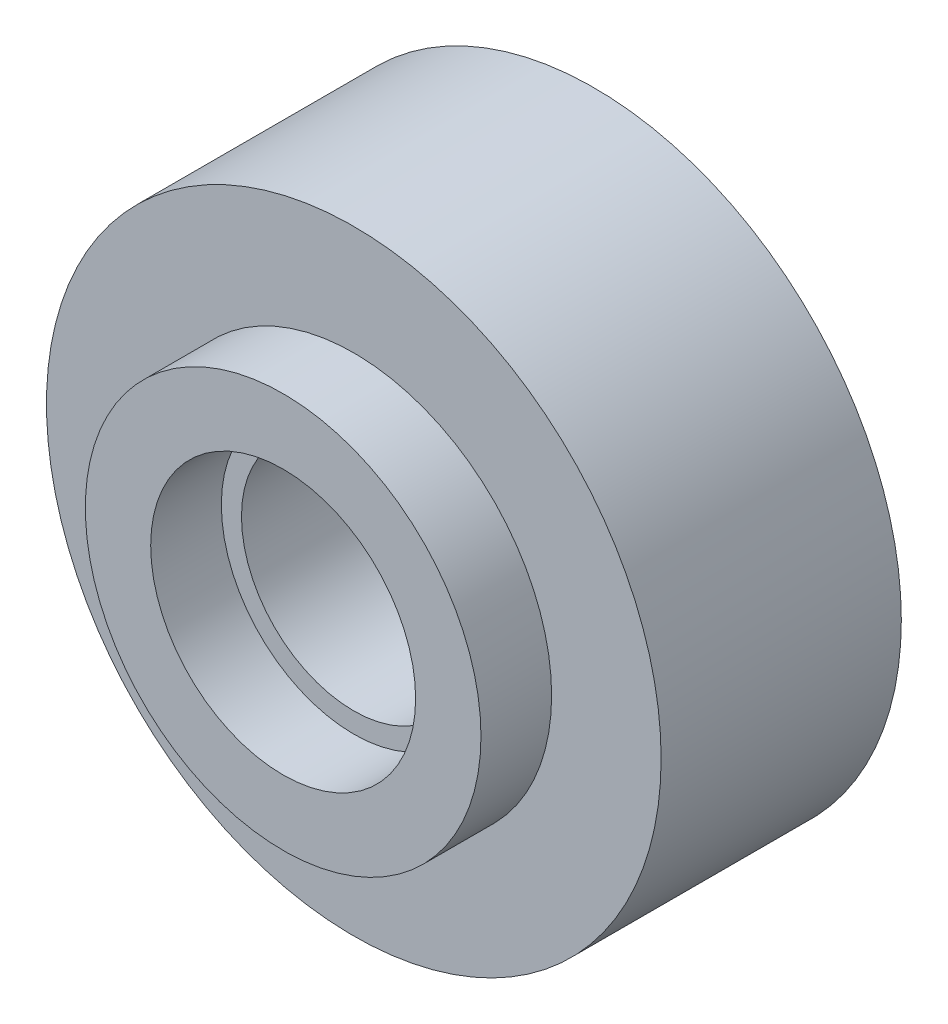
ISO-10303-21;
HEADER;
FILE_DESCRIPTION(('STEP AP214'),'2;1');
FILE_NAME('part.step','',(''),(''),'','','');
FILE_SCHEMA(('AUTOMOTIVE_DESIGN { 1 0 10303 214 1 1 1 1 }'));
ENDSEC;
DATA;
#1=APPLICATION_CONTEXT('core data for automotive mechanical design processes');
#2=APPLICATION_PROTOCOL_DEFINITION('international standard','automotive_design',2000,#1);
#3=PRODUCT_CONTEXT('',#1,'mechanical');
#4=PRODUCT('Part','Part','',(#3));
#5=PRODUCT_RELATED_PRODUCT_CATEGORY('part','',(#4));
#6=PRODUCT_DEFINITION_FORMATION('','',#4);
#7=PRODUCT_DEFINITION_CONTEXT('part definition',#1,'design');
#8=PRODUCT_DEFINITION('design','',#6,#7);
#9=PRODUCT_DEFINITION_SHAPE('','',#8);
#10=(LENGTH_UNIT() NAMED_UNIT(*) SI_UNIT(.MILLI.,.METRE.));
#11=(NAMED_UNIT(*) PLANE_ANGLE_UNIT() SI_UNIT($,.RADIAN.));
#12=(NAMED_UNIT(*) SI_UNIT($,.STERADIAN.) SOLID_ANGLE_UNIT());
#13=UNCERTAINTY_MEASURE_WITH_UNIT(LENGTH_MEASURE(1.E-05),#10,'distance_accuracy_value','');
#14=(GEOMETRIC_REPRESENTATION_CONTEXT(3) GLOBAL_UNCERTAINTY_ASSIGNED_CONTEXT((#13)) GLOBAL_UNIT_ASSIGNED_CONTEXT((#10,
#11,#12)) REPRESENTATION_CONTEXT('',''));
#15=CARTESIAN_POINT('',(0.,0.,0.));
#16=DIRECTION('',(0.,0.,1.));
#17=DIRECTION('',(1.,0.,0.));
#18=AXIS2_PLACEMENT_3D('',#15,#16,#17);
#19=CARTESIAN_POINT('',(0.,2.22044604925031E-13,5.58800000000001));
#20=DIRECTION('',(0.,0.,1.));
#21=DIRECTION('',(1.00000000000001,0.,0.));
#22=AXIS2_PLACEMENT_3D('',#19,#20,#21);
#23=PLANE('',#22);
#24=CARTESIAN_POINT('',(0.,2.22044604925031E-13,5.58800000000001));
#25=DIRECTION('',(0.,0.,1.));
#26=DIRECTION('',(1.00000000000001,0.,0.));
#27=AXIS2_PLACEMENT_3D('',#24,#25,#26);
#28=CIRCLE('',#27,2.38125);
#29=CARTESIAN_POINT('',(2.38125000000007,2.24291765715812E-13,5.58800000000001));
#30=VERTEX_POINT('',#29);
#31=EDGE_CURVE('E45',#30,#30,#28,.T.);
#32=ORIENTED_EDGE('',*,*,#31,.F.);
#33=EDGE_LOOP('',(#32));
#34=FACE_BOUND('',#33,.T.);
#35=CARTESIAN_POINT('',(0.,2.22044604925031E-13,5.58800000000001));
#36=DIRECTION('',(0.,0.,1.));
#37=DIRECTION('',(1.00000000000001,0.,0.));
#38=AXIS2_PLACEMENT_3D('',#35,#36,#37);
#39=CIRCLE('',#38,3.556);
#40=CARTESIAN_POINT('',(3.55600000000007,2.25400365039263E-13,5.588));
#41=VERTEX_POINT('',#40);
#42=EDGE_CURVE('E50',#41,#41,#39,.T.);
#43=ORIENTED_EDGE('',*,*,#42,.T.);
#44=EDGE_LOOP('',(#43));
#45=FACE_BOUND('',#44,.T.);
#46=ADVANCED_FACE('F33',(#34,#45),#23,.T.);
#47=CARTESIAN_POINT('',(0.,2.22044604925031E-13,4.31799999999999));
#48=DIRECTION('',(0.,0.,1.));
#49=DIRECTION('',(1.00000000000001,0.,0.));
#50=AXIS2_PLACEMENT_3D('',#47,#48,#49);
#51=CYLINDRICAL_SURFACE('',#50,2.38125);
#52=CARTESIAN_POINT('',(0.,2.22044604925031E-13,4.31799999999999));
#53=DIRECTION('',(0.,0.,1.));
#54=DIRECTION('',(1.00000000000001,0.,0.));
#55=AXIS2_PLACEMENT_3D('',#52,#53,#54);
#56=CIRCLE('',#55,2.38125);
#57=CARTESIAN_POINT('',(2.38125000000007,2.24291765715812E-13,4.31799999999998));
#58=VERTEX_POINT('',#57);
#59=EDGE_CURVE('E41',#58,#58,#56,.T.);
#60=ORIENTED_EDGE('',*,*,#59,.F.);
#61=EDGE_LOOP('',(#60));
#62=FACE_BOUND('',#61,.T.);
#63=ORIENTED_EDGE('',*,*,#31,.T.);
#64=EDGE_LOOP('',(#63));
#65=FACE_BOUND('',#64,.T.);
#66=ADVANCED_FACE('F78',(#62,#65),#51,.F.);
#67=CARTESIAN_POINT('',(0.,2.22044604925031E-13,4.31799999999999));
#68=DIRECTION('',(0.,0.,1.));
#69=DIRECTION('',(1.00000000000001,0.,0.));
#70=AXIS2_PLACEMENT_3D('',#67,#68,#69);
#71=PLANE('',#70);
#72=CARTESIAN_POINT('',(0.,2.22044604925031E-13,4.31799999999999));
#73=DIRECTION('',(0.,0.,1.));
#74=DIRECTION('',(1.00000000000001,0.,0.));
#75=AXIS2_PLACEMENT_3D('',#72,#73,#74);
#76=CIRCLE('',#75,2.0193);
#77=CARTESIAN_POINT('',(2.01930000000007,2.23950197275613E-13,4.31799999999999));
#78=VERTEX_POINT('',#77);
#79=EDGE_CURVE('E54',#78,#78,#76,.T.);
#80=ORIENTED_EDGE('',*,*,#79,.F.);
#81=EDGE_LOOP('',(#80));
#82=FACE_BOUND('',#81,.T.);
#83=ORIENTED_EDGE('',*,*,#59,.T.);
#84=EDGE_LOOP('',(#83));
#85=FACE_BOUND('',#84,.T.);
#86=ADVANCED_FACE('F83',(#82,#85),#71,.T.);
#87=CARTESIAN_POINT('',(0.,2.22044604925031E-13,4.31799999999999));
#88=DIRECTION('',(0.,0.,1.));
#89=DIRECTION('',(1.00000000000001,0.,0.));
#90=AXIS2_PLACEMENT_3D('',#87,#88,#89);
#91=PLANE('',#90);
#92=CARTESIAN_POINT('',(0.,2.22044604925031E-13,4.31799999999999));
#93=DIRECTION('',(0.,0.,1.));
#94=DIRECTION('',(1.00000000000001,0.,0.));
#95=AXIS2_PLACEMENT_3D('',#92,#93,#94);
#96=CIRCLE('',#95,3.556);
#97=CARTESIAN_POINT('',(3.55600000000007,2.25400365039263E-13,4.31799999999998));
#98=VERTEX_POINT('',#97);
#99=EDGE_CURVE('E53',#98,#98,#96,.T.);
#100=ORIENTED_EDGE('',*,*,#99,.F.);
#101=EDGE_LOOP('',(#100));
#102=FACE_BOUND('',#101,.T.);
#103=CARTESIAN_POINT('',(0.,2.22044604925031E-13,4.31799999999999));
#104=DIRECTION('',(0.,0.,1.));
#105=DIRECTION('',(1.00000000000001,0.,0.));
#106=AXIS2_PLACEMENT_3D('',#103,#104,#105);
#107=CIRCLE('',#106,5.5245);
#108=CARTESIAN_POINT('',(5.52450000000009,2.27258017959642E-13,4.31799999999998));
#109=VERTEX_POINT('',#108);
#110=EDGE_CURVE('E37',#109,#109,#107,.T.);
#111=ORIENTED_EDGE('',*,*,#110,.T.);
#112=EDGE_LOOP('',(#111));
#113=FACE_BOUND('',#112,.T.);
#114=ADVANCED_FACE('F73',(#102,#113),#91,.T.);
#115=CARTESIAN_POINT('',(0.,2.22044604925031E-13,4.31799999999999));
#116=DIRECTION('',(0.,0.,1.));
#117=DIRECTION('',(1.00000000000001,0.,0.));
#118=AXIS2_PLACEMENT_3D('',#115,#116,#117);
#119=CYLINDRICAL_SURFACE('',#118,3.556);
#120=ORIENTED_EDGE('',*,*,#99,.T.);
#121=EDGE_LOOP('',(#120));
#122=FACE_BOUND('',#121,.T.);
#123=ORIENTED_EDGE('',*,*,#42,.F.);
#124=EDGE_LOOP('',(#123));
#125=FACE_BOUND('',#124,.T.);
#126=ADVANCED_FACE('F68',(#122,#125),#119,.T.);
#127=CARTESIAN_POINT('',(0.,0.,0.));
#128=DIRECTION('',(0.,0.,1.));
#129=DIRECTION('',(1.00000000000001,0.,0.));
#130=AXIS2_PLACEMENT_3D('',#127,#128,#129);
#131=PLANE('',#130);
#132=CARTESIAN_POINT('',(0.,0.,0.));
#133=DIRECTION('',(0.,0.,-1.));
#134=DIRECTION('',(-1.00000000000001,0.,0.));
#135=AXIS2_PLACEMENT_3D('',#132,#133,#134);
#136=CIRCLE('',#135,2.0193);
#137=CARTESIAN_POINT('',(-2.01930000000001,0.,0.));
#138=VERTEX_POINT('',#137);
#139=EDGE_CURVE('E59',#138,#138,#136,.T.);
#140=ORIENTED_EDGE('',*,*,#139,.F.);
#141=EDGE_LOOP('',(#140));
#142=FACE_BOUND('',#141,.T.);
#143=CARTESIAN_POINT('',(0.,0.,0.));
#144=DIRECTION('',(0.,0.,1.));
#145=DIRECTION('',(1.00000000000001,0.,0.));
#146=AXIS2_PLACEMENT_3D('',#143,#144,#145);
#147=CIRCLE('',#146,5.5245);
#148=CARTESIAN_POINT('',(5.52450000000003,0.,0.));
#149=VERTEX_POINT('',#148);
#150=EDGE_CURVE('E11',#149,#149,#147,.T.);
#151=ORIENTED_EDGE('',*,*,#150,.F.);
#152=EDGE_LOOP('',(#151));
#153=FACE_BOUND('',#152,.T.);
#154=ADVANCED_FACE('F65',(#142,#153),#131,.F.);
#155=CARTESIAN_POINT('',(0.,2.22044604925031E-13,5.58800000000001));
#156=DIRECTION('',(0.,0.,-1.));
#157=DIRECTION('',(-1.00000000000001,0.,0.));
#158=AXIS2_PLACEMENT_3D('',#155,#156,#157);
#159=CYLINDRICAL_SURFACE('',#158,5.5245);
#160=ORIENTED_EDGE('',*,*,#150,.T.);
#161=EDGE_LOOP('',(#160));
#162=FACE_BOUND('',#161,.T.);
#163=ORIENTED_EDGE('',*,*,#110,.F.);
#164=EDGE_LOOP('',(#163));
#165=FACE_BOUND('',#164,.T.);
#166=ADVANCED_FACE('F35',(#162,#165),#159,.T.);
#167=CARTESIAN_POINT('',(0.,2.22044604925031E-13,5.58800000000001));
#168=DIRECTION('',(0.,0.,-1.));
#169=DIRECTION('',(-1.00000000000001,0.,0.));
#170=AXIS2_PLACEMENT_3D('',#167,#168,#169);
#171=CYLINDRICAL_SURFACE('',#170,2.0193);
#172=ORIENTED_EDGE('',*,*,#79,.T.);
#173=EDGE_LOOP('',(#172));
#174=FACE_BOUND('',#173,.T.);
#175=ORIENTED_EDGE('',*,*,#139,.T.);
#176=EDGE_LOOP('',(#175));
#177=FACE_BOUND('',#176,.T.);
#178=ADVANCED_FACE('F63',(#174,#177),#171,.F.);
#179=CLOSED_SHELL('',(#46,#66,#86,#114,#126,#154,#166,#178));
#180=MANIFOLD_SOLID_BREP('B2',#179);
#181=ADVANCED_BREP_SHAPE_REPRESENTATION('',(#18,#180),#14);
#182=SHAPE_DEFINITION_REPRESENTATION(#9,#181);
ENDSEC;
END-ISO-10303-21;
